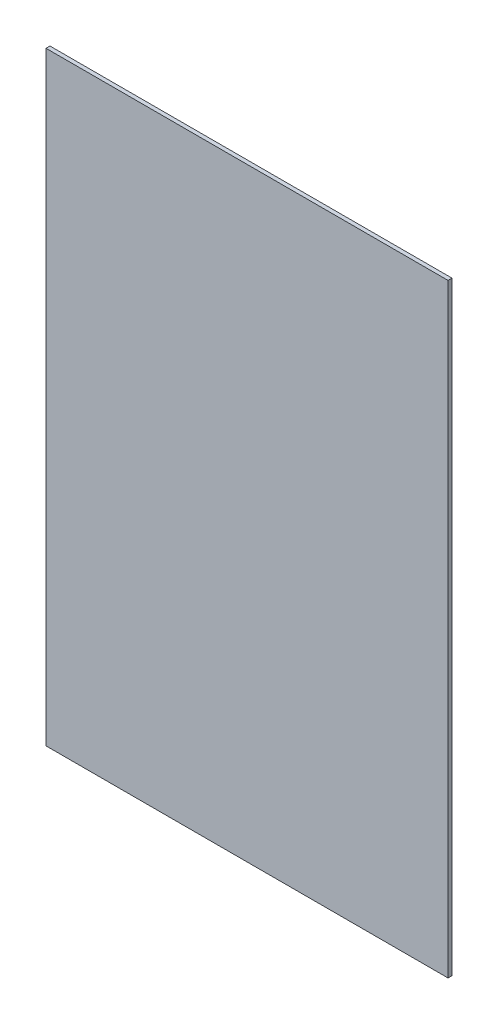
ISO-10303-21;
HEADER;
FILE_DESCRIPTION(('STEP AP214'),'2;1');
FILE_NAME('part.step','',(''),(''),'','','');
FILE_SCHEMA(('AUTOMOTIVE_DESIGN { 1 0 10303 214 1 1 1 1 }'));
ENDSEC;
DATA;
#1=APPLICATION_CONTEXT('core data for automotive mechanical design processes');
#2=APPLICATION_PROTOCOL_DEFINITION('international standard','automotive_design',2000,#1);
#3=PRODUCT_CONTEXT('',#1,'mechanical');
#4=PRODUCT('Part','Part','',(#3));
#5=PRODUCT_RELATED_PRODUCT_CATEGORY('part','',(#4));
#6=PRODUCT_DEFINITION_FORMATION('','',#4);
#7=PRODUCT_DEFINITION_CONTEXT('part definition',#1,'design');
#8=PRODUCT_DEFINITION('design','',#6,#7);
#9=PRODUCT_DEFINITION_SHAPE('','',#8);
#10=(LENGTH_UNIT() NAMED_UNIT(*) SI_UNIT(.MILLI.,.METRE.));
#11=(NAMED_UNIT(*) PLANE_ANGLE_UNIT() SI_UNIT($,.RADIAN.));
#12=(NAMED_UNIT(*) SI_UNIT($,.STERADIAN.) SOLID_ANGLE_UNIT());
#13=UNCERTAINTY_MEASURE_WITH_UNIT(LENGTH_MEASURE(1.E-05),#10,'distance_accuracy_value','');
#14=(GEOMETRIC_REPRESENTATION_CONTEXT(3) GLOBAL_UNCERTAINTY_ASSIGNED_CONTEXT((#13)) GLOBAL_UNIT_ASSIGNED_CONTEXT((#10,
#11,#12)) REPRESENTATION_CONTEXT('',''));
#15=CARTESIAN_POINT('',(0.,0.,0.));
#16=DIRECTION('',(0.,0.,1.));
#17=DIRECTION('',(1.,0.,0.));
#18=AXIS2_PLACEMENT_3D('',#15,#16,#17);
#19=CARTESIAN_POINT('',(0.,0.,18.));
#20=DIRECTION('',(-1.,0.,0.));
#21=DIRECTION('',(0.,0.,1.));
#22=AXIS2_PLACEMENT_3D('',#19,#20,#21);
#23=PLANE('',#22);
#24=DIRECTION('',(0.,1.,0.));
#25=VECTOR('',#24,1.);
#26=CARTESIAN_POINT('',(0.,0.,0.));
#27=LINE('',#26,#25);
#28=CARTESIAN_POINT('',(0.,0.,0.));
#29=VERTEX_POINT('',#28);
#30=CARTESIAN_POINT('',(0.,2750.,0.));
#31=VERTEX_POINT('',#30);
#32=EDGE_CURVE('E95',#29,#31,#27,.T.);
#33=ORIENTED_EDGE('',*,*,#32,.T.);
#34=DIRECTION('',(0.,0.,-1.));
#35=VECTOR('',#34,1.);
#36=CARTESIAN_POINT('',(0.,2750.,18.));
#37=LINE('',#36,#35);
#38=CARTESIAN_POINT('',(0.,2750.,18.));
#39=VERTEX_POINT('',#38);
#40=EDGE_CURVE('E11',#39,#31,#37,.T.);
#41=ORIENTED_EDGE('',*,*,#40,.F.);
#42=DIRECTION('',(0.,1.,0.));
#43=VECTOR('',#42,1.);
#44=CARTESIAN_POINT('',(0.,0.,18.));
#45=LINE('',#44,#43);
#46=CARTESIAN_POINT('',(0.,0.,18.));
#47=VERTEX_POINT('',#46);
#48=EDGE_CURVE('E83',#47,#39,#45,.T.);
#49=ORIENTED_EDGE('',*,*,#48,.F.);
#50=DIRECTION('',(0.,0.,-1.));
#51=VECTOR('',#50,1.);
#52=CARTESIAN_POINT('',(0.,0.,18.));
#53=LINE('',#52,#51);
#54=EDGE_CURVE('E91',#47,#29,#53,.T.);
#55=ORIENTED_EDGE('',*,*,#54,.T.);
#56=EDGE_LOOP('',(#33,#41,#49,#55));
#57=FACE_BOUND('',#56,.T.);
#58=ADVANCED_FACE('F32',(#57),#23,.F.);
#59=CARTESIAN_POINT('',(0.,2750.,18.));
#60=DIRECTION('',(0.,-1.,0.));
#61=DIRECTION('',(1.,0.,0.));
#62=AXIS2_PLACEMENT_3D('',#59,#60,#61);
#63=PLANE('',#62);
#64=DIRECTION('',(-1.,0.,0.));
#65=VECTOR('',#64,1.);
#66=CARTESIAN_POINT('',(0.,2750.,0.));
#67=LINE('',#66,#65);
#68=CARTESIAN_POINT('',(-1830.,2750.,0.));
#69=VERTEX_POINT('',#68);
#70=EDGE_CURVE('E87',#31,#69,#67,.T.);
#71=ORIENTED_EDGE('',*,*,#70,.T.);
#72=DIRECTION('',(0.,0.,-1.));
#73=VECTOR('',#72,1.);
#74=CARTESIAN_POINT('',(-1830.,2750.,18.));
#75=LINE('',#74,#73);
#76=CARTESIAN_POINT('',(-1830.,2750.,18.));
#77=VERTEX_POINT('',#76);
#78=EDGE_CURVE('E40',#77,#69,#75,.T.);
#79=ORIENTED_EDGE('',*,*,#78,.F.);
#80=DIRECTION('',(-1.,0.,0.));
#81=VECTOR('',#80,1.);
#82=CARTESIAN_POINT('',(0.,2750.,18.));
#83=LINE('',#82,#81);
#84=EDGE_CURVE('E78',#39,#77,#83,.T.);
#85=ORIENTED_EDGE('',*,*,#84,.F.);
#86=ORIENTED_EDGE('',*,*,#40,.T.);
#87=EDGE_LOOP('',(#71,#79,#85,#86));
#88=FACE_BOUND('',#87,.T.);
#89=ADVANCED_FACE('F86',(#88),#63,.F.);
#90=CARTESIAN_POINT('',(-1830.,-2.24110364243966E-13,18.));
#91=DIRECTION('',(1.,0.,0.));
#92=DIRECTION('',(0.,0.,-1.));
#93=AXIS2_PLACEMENT_3D('',#90,#91,#92);
#94=PLANE('',#93);
#95=DIRECTION('',(0.,-1.,0.));
#96=VECTOR('',#95,1.);
#97=CARTESIAN_POINT('',(-1830.,-2.24110364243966E-13,0.));
#98=LINE('',#97,#96);
#99=CARTESIAN_POINT('',(-1830.,-2.24110364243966E-13,0.));
#100=VERTEX_POINT('',#99);
#101=EDGE_CURVE('E65',#69,#100,#98,.T.);
#102=ORIENTED_EDGE('',*,*,#101,.T.);
#103=DIRECTION('',(0.,0.,-1.));
#104=VECTOR('',#103,1.);
#105=CARTESIAN_POINT('',(-1830.,-2.24110364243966E-13,18.));
#106=LINE('',#105,#104);
#107=CARTESIAN_POINT('',(-1830.,-2.24110364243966E-13,18.));
#108=VERTEX_POINT('',#107);
#109=EDGE_CURVE('E88',#108,#100,#106,.T.);
#110=ORIENTED_EDGE('',*,*,#109,.F.);
#111=DIRECTION('',(0.,-1.,0.));
#112=VECTOR('',#111,1.);
#113=CARTESIAN_POINT('',(-1830.,-2.24110364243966E-13,18.));
#114=LINE('',#113,#112);
#115=EDGE_CURVE('E81',#77,#108,#114,.T.);
#116=ORIENTED_EDGE('',*,*,#115,.F.);
#117=ORIENTED_EDGE('',*,*,#78,.T.);
#118=EDGE_LOOP('',(#102,#110,#116,#117));
#119=FACE_BOUND('',#118,.T.);
#120=ADVANCED_FACE('F89',(#119),#94,.F.);
#121=CARTESIAN_POINT('',(0.,0.,18.));
#122=DIRECTION('',(0.,1.,0.));
#123=DIRECTION('',(-1.,0.,0.));
#124=AXIS2_PLACEMENT_3D('',#121,#122,#123);
#125=PLANE('',#124);
#126=DIRECTION('',(1.,0.,0.));
#127=VECTOR('',#126,1.);
#128=CARTESIAN_POINT('',(0.,0.,0.));
#129=LINE('',#128,#127);
#130=EDGE_CURVE('E71',#100,#29,#129,.T.);
#131=ORIENTED_EDGE('',*,*,#130,.T.);
#132=ORIENTED_EDGE('',*,*,#54,.F.);
#133=DIRECTION('',(1.,0.,0.));
#134=VECTOR('',#133,1.);
#135=CARTESIAN_POINT('',(0.,0.,18.));
#136=LINE('',#135,#134);
#137=EDGE_CURVE('E48',#108,#47,#136,.T.);
#138=ORIENTED_EDGE('',*,*,#137,.F.);
#139=ORIENTED_EDGE('',*,*,#109,.T.);
#140=EDGE_LOOP('',(#131,#132,#138,#139));
#141=FACE_BOUND('',#140,.T.);
#142=ADVANCED_FACE('F102',(#141),#125,.F.);
#143=CARTESIAN_POINT('',(0.,0.,18.));
#144=DIRECTION('',(0.,0.,1.));
#145=DIRECTION('',(1.,0.,0.));
#146=AXIS2_PLACEMENT_3D('',#143,#144,#145);
#147=PLANE('',#146);
#148=ORIENTED_EDGE('',*,*,#48,.T.);
#149=ORIENTED_EDGE('',*,*,#84,.T.);
#150=ORIENTED_EDGE('',*,*,#115,.T.);
#151=ORIENTED_EDGE('',*,*,#137,.T.);
#152=EDGE_LOOP('',(#148,#149,#150,#151));
#153=FACE_BOUND('',#152,.T.);
#154=ADVANCED_FACE('F79',(#153),#147,.T.);
#155=CARTESIAN_POINT('',(0.,0.,0.));
#156=DIRECTION('',(0.,0.,1.));
#157=DIRECTION('',(1.,0.,0.));
#158=AXIS2_PLACEMENT_3D('',#155,#156,#157);
#159=PLANE('',#158);
#160=ORIENTED_EDGE('',*,*,#32,.F.);
#161=ORIENTED_EDGE('',*,*,#130,.F.);
#162=ORIENTED_EDGE('',*,*,#101,.F.);
#163=ORIENTED_EDGE('',*,*,#70,.F.);
#164=EDGE_LOOP('',(#160,#161,#162,#163));
#165=FACE_BOUND('',#164,.T.);
#166=ADVANCED_FACE('F105',(#165),#159,.F.);
#167=CLOSED_SHELL('',(#58,#89,#120,#142,#154,#166));
#168=MANIFOLD_SOLID_BREP('B2',#167);
#169=ADVANCED_BREP_SHAPE_REPRESENTATION('',(#18,#168),#14);
#170=SHAPE_DEFINITION_REPRESENTATION(#9,#169);
ENDSEC;
END-ISO-10303-21;
